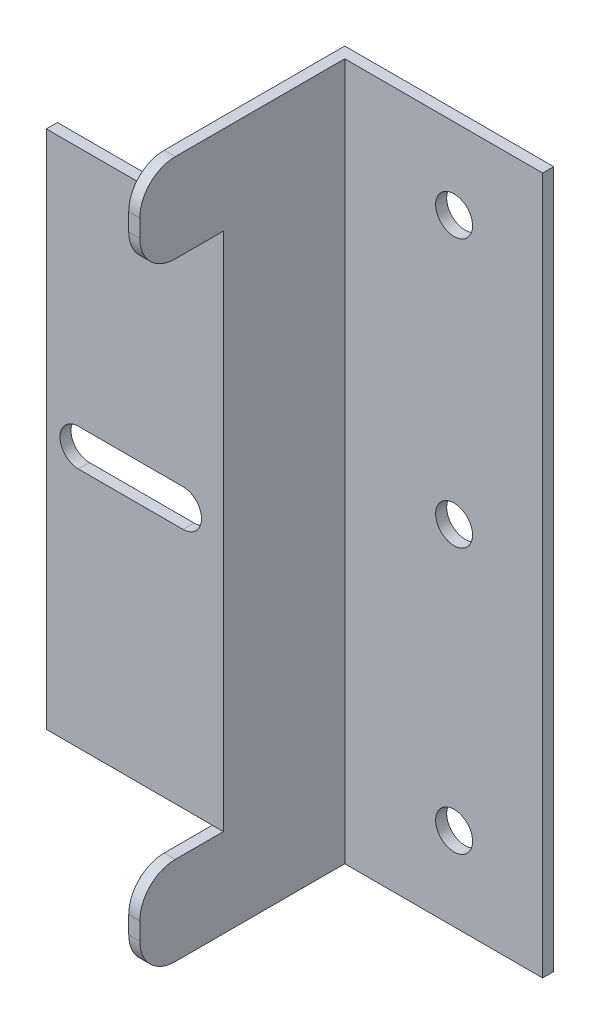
from build123d import *

# Parameters (mm, degrees)
BOSS_EXTRUDE1_DEPTH     = 49.9999
BOSS_EXTRUDE2_DEPTH     = 1.5875
SKETCH3_W               = 12.7
SKETCH3_H               = 1.5875
CUT_EXTRUDE1_DEPTH      = 23.8125
CUT_EXTRUDE2_DEPTH      = 62.31297077
CUT_EXTRUDE2_DEPTH_BACK = 62.31297077
SKETCH4_R               = 2.65


with BuildPart() as part:
    # Sketch1 → Boss-Extrude1 (new, symmetric)
    with BuildSketch(Plane(origin=(0, 0, 0), x_dir=(-1, 0, 0), z_dir=(0, 1, 0))):
        Polygon((-29.972, 0), (0, 0), (0, 17.4117), (23.8125, 17.4117), (23.8125, 18.9992), (-1.5875, 18.9992), (-1.5875, 1.5875), (-29.972, 1.5875), align=None)
    extrude(amount=BOSS_EXTRUDE1_DEPTH, both=True)

    # Sketch2 → Boss-Extrude2 (add)
    with BuildSketch(Plane.YZ.offset(1.5875)):
        with BuildLine():
            Line((-49.9999, 18.9992), (-49.9999, 25.908))
            ThreePointArc((-49.9999, 25.908), (-48.512002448, 29.500102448), (-44.9199, 30.988))
            Line((-44.9199, 30.988), (-42.3799, 30.988))
            ThreePointArc((-42.3799, 30.988), (-38.787797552, 29.500102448), (-37.2999, 25.908))
            Line((-37.2999, 25.908), (-37.2999, 18.9992))
            Line((-37.2999, 18.9992), (-49.9999, 18.9992))
        make_face()
        with BuildLine():
            Line((49.9999, 18.9992), (37.2999, 18.9992))
            Line((37.2999, 18.9992), (37.2999, 25.908))
            ThreePointArc((37.2999, 25.908), (38.787797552, 29.500102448), (42.3799, 30.988))
            Line((42.3799, 30.988), (44.9199, 30.988))
            ThreePointArc((44.9199, 30.988), (48.512002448, 29.500102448), (49.9999, 25.908))
            Line((49.9999, 25.908), (49.9999, 18.9992))
        make_face()
    extrude(amount=-BOSS_EXTRUDE2_DEPTH)

    # Sketch3 → Cut-Extrude1 (cut)
    with BuildSketch(Plane(origin=(-23.8125, 0, 0), x_dir=(0, -1, 0), z_dir=(-1, 0, 0))):
        with Locations((-43.6499, 18.20545)):
            Rectangle(SKETCH3_W, SKETCH3_H)
        with Locations((43.6499, 18.20545)):
            Rectangle(SKETCH3_W, SKETCH3_H)
    extrude(amount=-CUT_EXTRUDE1_DEPTH, mode=Mode.SUBTRACT)

    # Sketch4 → Cut-Extrude2 (cut, two sides: drawn at the far end of the back side and taken through both)
    with BuildSketch(Plane.XY.offset(18.9992).offset(-CUT_EXTRUDE2_DEPTH_BACK)):
        with Locations((17.272, -38.049477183)):
            Circle(SKETCH4_R)
        with Locations((17.272, 38.408858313)):
            Circle(SKETCH4_R)
        with Locations((17.272, 0)):
            Circle(SKETCH4_R)
        with BuildLine():
            Line((-19.201880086, 2.65), (-4.197717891, 2.65))
            ThreePointArc((-4.197717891, 2.65), (-1.547717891, 0), (-4.197717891, -2.65))
            Line((-4.197717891, -2.65), (-19.201880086, -2.65))
            ThreePointArc((-19.201880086, -2.65), (-21.851880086, 0), (-19.201880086, 2.65))
        make_face()
    extrude(amount=CUT_EXTRUDE2_DEPTH + CUT_EXTRUDE2_DEPTH_BACK, mode=Mode.SUBTRACT)


solid = part.part
